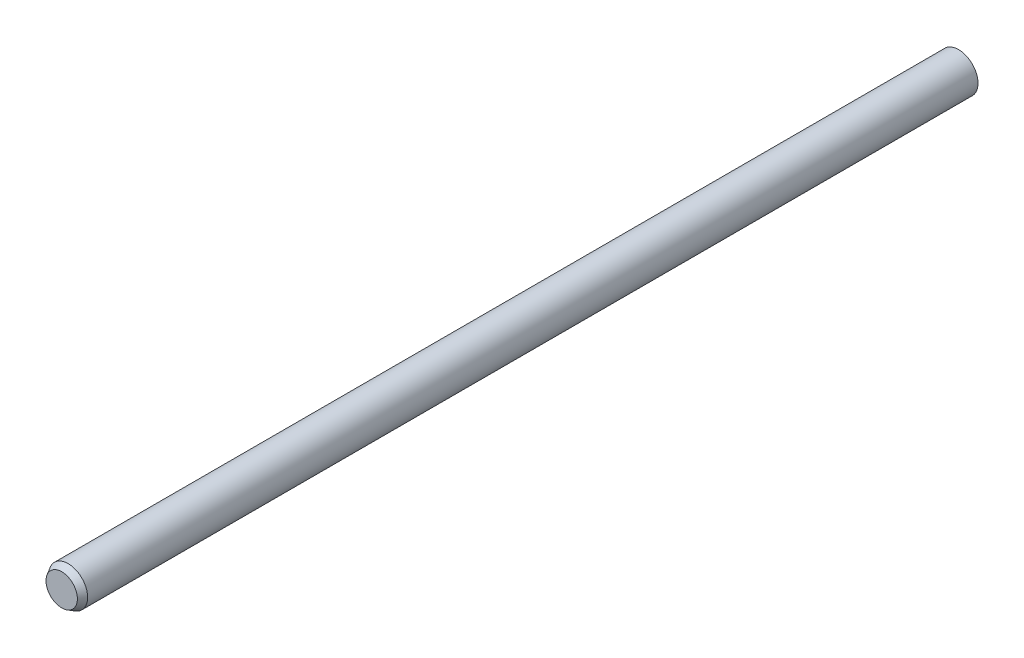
ISO-10303-21;
HEADER;
FILE_DESCRIPTION(('STEP AP214'),'2;1');
FILE_NAME('part.step','',(''),(''),'','','');
FILE_SCHEMA(('AUTOMOTIVE_DESIGN { 1 0 10303 214 1 1 1 1 }'));
ENDSEC;
DATA;
#1=APPLICATION_CONTEXT('core data for automotive mechanical design processes');
#2=APPLICATION_PROTOCOL_DEFINITION('international standard','automotive_design',2000,#1);
#3=PRODUCT_CONTEXT('',#1,'mechanical');
#4=PRODUCT('Part','Part','',(#3));
#5=PRODUCT_RELATED_PRODUCT_CATEGORY('part','',(#4));
#6=PRODUCT_DEFINITION_FORMATION('','',#4);
#7=PRODUCT_DEFINITION_CONTEXT('part definition',#1,'design');
#8=PRODUCT_DEFINITION('design','',#6,#7);
#9=PRODUCT_DEFINITION_SHAPE('','',#8);
#10=(LENGTH_UNIT() NAMED_UNIT(*) SI_UNIT(.MILLI.,.METRE.));
#11=(NAMED_UNIT(*) PLANE_ANGLE_UNIT() SI_UNIT($,.RADIAN.));
#12=(NAMED_UNIT(*) SI_UNIT($,.STERADIAN.) SOLID_ANGLE_UNIT());
#13=UNCERTAINTY_MEASURE_WITH_UNIT(LENGTH_MEASURE(1.E-05),#10,'distance_accuracy_value','');
#14=(GEOMETRIC_REPRESENTATION_CONTEXT(3) GLOBAL_UNCERTAINTY_ASSIGNED_CONTEXT((#13)) GLOBAL_UNIT_ASSIGNED_CONTEXT((#10,
#11,#12)) REPRESENTATION_CONTEXT('',''));
#15=CARTESIAN_POINT('',(0.,0.,0.));
#16=DIRECTION('',(0.,0.,1.));
#17=DIRECTION('',(1.,0.,0.));
#18=AXIS2_PLACEMENT_3D('',#15,#16,#17);
#19=CARTESIAN_POINT('',(0.,1.11022302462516E-13,277.999999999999));
#20=DIRECTION('',(0.,0.,-0.999999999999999));
#21=DIRECTION('',(-1.,0.,0.));
#22=AXIS2_PLACEMENT_3D('',#19,#20,#21);
#23=CYLINDRICAL_SURFACE('',#22,6.);
#24=CARTESIAN_POINT('',(0.,1.11022302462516E-13,275.999999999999));
#25=DIRECTION('',(0.,0.,0.999999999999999));
#26=DIRECTION('',(1.,0.,0.));
#27=AXIS2_PLACEMENT_3D('',#24,#25,#26);
#28=CIRCLE('',#27,6.);
#29=CARTESIAN_POINT('',(-6.00000000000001,1.11023738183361E-13,275.999999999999));
#30=VERTEX_POINT('',#29);
#31=EDGE_CURVE('E40',#30,#30,#28,.F.);
#32=CARTESIAN_POINT('',(0.,0.,1.15470053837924));
#33=DIRECTION('',(0.,0.,0.999999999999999));
#34=DIRECTION('',(1.,0.,0.));
#35=AXIS2_PLACEMENT_3D('',#32,#33,#34);
#36=CIRCLE('',#35,6.);
#37=CARTESIAN_POINT('',(-6.00000000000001,1.11023738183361E-13,1.15470053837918));
#38=VERTEX_POINT('',#37);
#39=EDGE_CURVE('E44',#38,#38,#36,.T.);
#40=CARTESIAN_POINT('',(-6.00000000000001,1.11023738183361E-13,275.999999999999));
#41=CARTESIAN_POINT('',(-6.00000000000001,1.11023738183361E-13,273.137028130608));
#42=CARTESIAN_POINT('',(-6.00000000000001,1.11023738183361E-13,270.274056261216));
#43=CARTESIAN_POINT('',(-6.00000000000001,1.11023738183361E-13,264.548112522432));
#44=CARTESIAN_POINT('',(-6.00000000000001,1.11023738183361E-13,261.68514065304));
#45=CARTESIAN_POINT('',(-6.00000000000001,1.11023738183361E-13,255.959196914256));
#46=CARTESIAN_POINT('',(-6.00000000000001,1.11023738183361E-13,253.096225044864));
#47=CARTESIAN_POINT('',(-6.00000000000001,1.11023738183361E-13,247.370281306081));
#48=CARTESIAN_POINT('',(-6.00000000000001,1.11023738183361E-13,244.507309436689));
#49=CARTESIAN_POINT('',(-6.00000000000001,1.11023738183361E-13,238.781365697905));
#50=CARTESIAN_POINT('',(-6.00000000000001,1.11023738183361E-13,235.918393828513));
#51=CARTESIAN_POINT('',(-6.00000000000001,1.11023738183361E-13,230.192450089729));
#52=CARTESIAN_POINT('',(-6.00000000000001,1.11023738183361E-13,227.329478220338));
#53=CARTESIAN_POINT('',(-6.00000000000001,1.11023738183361E-13,221.603534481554));
#54=CARTESIAN_POINT('',(-6.00000000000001,1.11023738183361E-13,218.740562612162));
#55=CARTESIAN_POINT('',(-6.00000000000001,1.11023738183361E-13,213.014618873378));
#56=CARTESIAN_POINT('',(-6.00000000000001,1.11023738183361E-13,210.151647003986));
#57=CARTESIAN_POINT('',(-6.00000000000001,1.11023738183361E-13,204.425703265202));
#58=CARTESIAN_POINT('',(-6.00000000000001,1.11023738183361E-13,201.562731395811));
#59=CARTESIAN_POINT('',(-6.00000000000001,1.11023738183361E-13,195.836787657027));
#60=CARTESIAN_POINT('',(-6.00000000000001,1.11023738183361E-13,192.973815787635));
#61=CARTESIAN_POINT('',(-6.00000000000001,1.11023738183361E-13,187.247872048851));
#62=CARTESIAN_POINT('',(-6.00000000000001,1.11023738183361E-13,184.384900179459));
#63=CARTESIAN_POINT('',(-6.00000000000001,1.11023738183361E-13,178.658956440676));
#64=CARTESIAN_POINT('',(-6.00000000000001,1.11023738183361E-13,175.795984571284));
#65=CARTESIAN_POINT('',(-6.00000000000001,1.11023738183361E-13,170.0700408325));
#66=CARTESIAN_POINT('',(-6.00000000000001,1.11023738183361E-13,167.207068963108));
#67=CARTESIAN_POINT('',(-6.00000000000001,1.11023738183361E-13,161.481125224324));
#68=CARTESIAN_POINT('',(-6.00000000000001,1.11023738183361E-13,158.618153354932));
#69=CARTESIAN_POINT('',(-6.00000000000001,1.11023738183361E-13,152.892209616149));
#70=CARTESIAN_POINT('',(-6.00000000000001,1.11023738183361E-13,150.029237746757));
#71=CARTESIAN_POINT('',(-6.00000000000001,1.11023738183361E-13,144.303294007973));
#72=CARTESIAN_POINT('',(-6.00000000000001,1.11023738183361E-13,141.440322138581));
#73=CARTESIAN_POINT('',(-6.00000000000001,1.11023738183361E-13,135.714378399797));
#74=CARTESIAN_POINT('',(-6.00000000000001,1.11023738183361E-13,132.851406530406));
#75=CARTESIAN_POINT('',(-6.00000000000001,1.11023738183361E-13,127.125462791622));
#76=CARTESIAN_POINT('',(-6.00000000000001,1.11023738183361E-13,124.26249092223));
#77=CARTESIAN_POINT('',(-6.00000000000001,1.11023738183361E-13,118.536547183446));
#78=CARTESIAN_POINT('',(-6.00000000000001,1.11023738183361E-13,115.673575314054));
#79=CARTESIAN_POINT('',(-6.00000000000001,1.11023738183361E-13,109.947631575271));
#80=CARTESIAN_POINT('',(-6.00000000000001,1.11023738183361E-13,107.084659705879));
#81=CARTESIAN_POINT('',(-6.00000000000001,1.11023738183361E-13,101.358715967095));
#82=CARTESIAN_POINT('',(-6.00000000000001,1.11023738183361E-13,98.495744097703));
#83=CARTESIAN_POINT('',(-6.00000000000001,1.11023738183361E-13,92.7698003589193));
#84=CARTESIAN_POINT('',(-6.00000000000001,1.11023738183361E-13,89.9068284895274));
#85=CARTESIAN_POINT('',(-6.00000000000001,1.11023738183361E-13,84.1808847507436));
#86=CARTESIAN_POINT('',(-6.00000000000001,1.11023738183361E-13,81.3179128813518));
#87=CARTESIAN_POINT('',(-6.00000000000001,1.11023738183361E-13,75.591969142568));
#88=CARTESIAN_POINT('',(-6.00000000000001,1.11023738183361E-13,72.7289972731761));
#89=CARTESIAN_POINT('',(-6.00000000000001,1.11023738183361E-13,67.0030535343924));
#90=CARTESIAN_POINT('',(-6.00000000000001,1.11023738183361E-13,64.1400816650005));
#91=CARTESIAN_POINT('',(-6.00000000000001,1.11023738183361E-13,58.4141379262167));
#92=CARTESIAN_POINT('',(-6.00000000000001,1.11023738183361E-13,55.5511660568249));
#93=CARTESIAN_POINT('',(-6.00000000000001,1.11023738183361E-13,49.8252223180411));
#94=CARTESIAN_POINT('',(-6.00000000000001,1.11023738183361E-13,46.9622504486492));
#95=CARTESIAN_POINT('',(-6.00000000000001,1.11023738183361E-13,41.2363067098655));
#96=CARTESIAN_POINT('',(-6.00000000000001,1.11023738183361E-13,38.3733348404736));
#97=CARTESIAN_POINT('',(-6.00000000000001,1.11023738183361E-13,32.6473911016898));
#98=CARTESIAN_POINT('',(-6.00000000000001,1.11023738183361E-13,29.784419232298));
#99=CARTESIAN_POINT('',(-6.00000000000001,1.11023738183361E-13,24.0584754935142));
#100=CARTESIAN_POINT('',(-6.00000000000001,1.11023738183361E-13,21.1955036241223));
#101=CARTESIAN_POINT('',(-6.00000000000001,1.11023738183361E-13,15.4695598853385));
#102=CARTESIAN_POINT('',(-6.00000000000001,1.11023738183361E-13,12.6065880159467));
#103=CARTESIAN_POINT('',(-6.00000000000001,1.11023738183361E-13,6.88064427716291));
#104=CARTESIAN_POINT('',(-6.00000000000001,1.11023738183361E-13,4.01767240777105));
#105=CARTESIAN_POINT('',(-6.00000000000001,1.11023738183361E-13,1.15470053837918));
#106=B_SPLINE_CURVE_WITH_KNOTS('',3,(#40,#41,#42,#43,#44,#45,#46,#47,#48,#49,#50,#51,#52,#53,
#54,#55,#56,#57,#58,#59,#60,#61,#62,#63,#64,#65,#66,#67,#68,#69,#70,#71,#72,#73,#74,#75,#76,#77,
#78,#79,#80,#81,#82,#83,#84,#85,#86,#87,#88,#89,#90,#91,#92,#93,#94,#95,#96,#97,#98,#99,#100,
#101,#102,#103,#104,#105),.UNSPECIFIED.,.F.,.F.,(4,2,2,2,2,2,2,2,2,2,2,2,2,2,2,2,2,2,2,2,2,2,2,
2,2,2,2,2,2,2,2,2,4),(0.,8.5889156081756,17.1778312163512,25.7667468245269,34.3556624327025,
42.9445780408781,51.5334936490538,60.1224092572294,68.711324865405,77.3002404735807,
85.8891560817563,94.4780716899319,103.066987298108,111.655902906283,120.244818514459,
128.833734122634,137.42264973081,146.011565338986,154.600480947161,163.189396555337,
171.778312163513,180.367227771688,188.956143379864,197.54505898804,206.133974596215,
214.722890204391,223.311805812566,231.900721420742,240.489637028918,249.078552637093,
257.667468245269,266.256383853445,274.84529946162),.UNSPECIFIED.);
#107=EDGE_CURVE('BSEAM34',#30,#38,#106,.T.);
#108=ORIENTED_EDGE('',*,*,#31,.T.);
#109=ORIENTED_EDGE('',*,*,#39,.T.);
#110=ORIENTED_EDGE('',*,*,#107,.T.);
#111=ORIENTED_EDGE('',*,*,#107,.F.);
#112=EDGE_LOOP('',(#108,#110,#109,#111));
#113=FACE_BOUND('',#112,.T.);
#114=ADVANCED_FACE('F34',(#113),#23,.T.);
#115=CARTESIAN_POINT('',(0.,1.11022302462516E-13,277.999999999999));
#116=DIRECTION('',(0.,0.,0.999999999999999));
#117=DIRECTION('',(1.,0.,0.));
#118=AXIS2_PLACEMENT_3D('',#115,#116,#117);
#119=PLANE('',#118);
#120=CARTESIAN_POINT('',(0.,1.11022302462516E-13,277.999999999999));
#121=DIRECTION('',(0.,0.,0.999999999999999));
#122=DIRECTION('',(1.,0.,0.));
#123=AXIS2_PLACEMENT_3D('',#120,#121,#122);
#124=CIRCLE('',#123,4.84529946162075);
#125=CARTESIAN_POINT('',(-4.84529946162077,1.11023461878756E-13,277.999999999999));
#126=VERTEX_POINT('',#125);
#127=EDGE_CURVE('E48',#126,#126,#124,.T.);
#128=ORIENTED_EDGE('',*,*,#127,.T.);
#129=EDGE_LOOP('',(#128));
#130=FACE_BOUND('',#129,.T.);
#131=ADVANCED_FACE('F54',(#130),#119,.T.);
#132=CARTESIAN_POINT('',(0.,0.,0.));
#133=DIRECTION('',(0.,0.,0.999999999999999));
#134=DIRECTION('',(1.,0.,0.));
#135=AXIS2_PLACEMENT_3D('',#132,#133,#134);
#136=PLANE('',#135);
#137=CARTESIAN_POINT('',(0.,0.,0.));
#138=DIRECTION('',(0.,0.,0.999999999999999));
#139=DIRECTION('',(1.,0.,0.));
#140=AXIS2_PLACEMENT_3D('',#137,#138,#139);
#141=CIRCLE('',#140,4.);
#142=CARTESIAN_POINT('',(4.00000000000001,0.,0.));
#143=VERTEX_POINT('',#142);
#144=EDGE_CURVE('E12',#143,#143,#141,.F.);
#145=ORIENTED_EDGE('',*,*,#144,.T.);
#146=EDGE_LOOP('',(#145));
#147=FACE_BOUND('',#146,.T.);
#148=ADVANCED_FACE('F59',(#147),#136,.F.);
#149=CARTESIAN_POINT('',(0.,1.11022302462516E-13,277.999999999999));
#150=DIRECTION('',(0.,0.,-0.999999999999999));
#151=DIRECTION('',(-1.,0.,0.));
#152=AXIS2_PLACEMENT_3D('',#149,#150,#151);
#153=CONICAL_SURFACE('',#152,4.84529946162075,0.5235987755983);
#154=CARTESIAN_POINT('',(-6.00000000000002,1.11023738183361E-13,275.999999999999));
#155=CARTESIAN_POINT('',(-5.9879718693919,1.11023735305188E-13,276.020833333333));
#156=CARTESIAN_POINT('',(-5.97594373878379,1.11023732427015E-13,276.041666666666));
#157=CARTESIAN_POINT('',(-5.95188747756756,1.11023726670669E-13,276.083333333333));
#158=CARTESIAN_POINT('',(-5.93985934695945,1.11023723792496E-13,276.104166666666));
#159=CARTESIAN_POINT('',(-5.91580308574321,1.1102371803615E-13,276.145833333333));
#160=CARTESIAN_POINT('',(-5.90377495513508,1.11023715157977E-13,276.166666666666));
#161=CARTESIAN_POINT('',(-5.87971869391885,1.11023709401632E-13,276.208333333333));
#162=CARTESIAN_POINT('',(-5.86769056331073,1.11023706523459E-13,276.229166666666));
#163=CARTESIAN_POINT('',(-5.8436343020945,1.11023700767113E-13,276.270833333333));
#164=CARTESIAN_POINT('',(-5.83160617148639,1.1102369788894E-13,276.291666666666));
#165=CARTESIAN_POINT('',(-5.80754991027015,1.11023692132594E-13,276.333333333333));
#166=CARTESIAN_POINT('',(-5.79552177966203,1.11023689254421E-13,276.354166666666));
#167=CARTESIAN_POINT('',(-5.77146551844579,1.11023683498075E-13,276.395833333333));
#168=CARTESIAN_POINT('',(-5.75943738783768,1.11023680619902E-13,276.416666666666));
#169=CARTESIAN_POINT('',(-5.73538112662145,1.11023674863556E-13,276.458333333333));
#170=CARTESIAN_POINT('',(-5.72335299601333,1.11023671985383E-13,276.479166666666));
#171=CARTESIAN_POINT('',(-5.69929673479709,1.11023666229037E-13,276.520833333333));
#172=CARTESIAN_POINT('',(-5.68726860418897,1.11023663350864E-13,276.541666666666));
#173=CARTESIAN_POINT('',(-5.66321234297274,1.11023657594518E-13,276.583333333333));
#174=CARTESIAN_POINT('',(-5.65118421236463,1.11023654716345E-13,276.604166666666));
#175=CARTESIAN_POINT('',(-5.62712795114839,1.11023648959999E-13,276.645833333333));
#176=CARTESIAN_POINT('',(-5.61509982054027,1.11023646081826E-13,276.666666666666));
#177=CARTESIAN_POINT('',(-5.59104355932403,1.1102364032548E-13,276.708333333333));
#178=CARTESIAN_POINT('',(-5.57901542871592,1.11023637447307E-13,276.729166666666));
#179=CARTESIAN_POINT('',(-5.55495916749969,1.11023631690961E-13,276.770833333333));
#180=CARTESIAN_POINT('',(-5.54293103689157,1.11023628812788E-13,276.791666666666));
#181=CARTESIAN_POINT('',(-5.51887477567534,1.11023623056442E-13,276.833333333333));
#182=CARTESIAN_POINT('',(-5.50684664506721,1.11023620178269E-13,276.854166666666));
#183=CARTESIAN_POINT('',(-5.48279038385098,1.11023614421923E-13,276.895833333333));
#184=CARTESIAN_POINT('',(-5.47076225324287,1.1102361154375E-13,276.916666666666));
#185=CARTESIAN_POINT('',(-5.44670599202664,1.11023605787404E-13,276.958333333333));
#186=CARTESIAN_POINT('',(-5.43467786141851,1.11023602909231E-13,276.979166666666));
#187=CARTESIAN_POINT('',(-5.41062160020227,1.11023597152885E-13,277.020833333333));
#188=CARTESIAN_POINT('',(-5.39859346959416,1.11023594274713E-13,277.041666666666));
#189=CARTESIAN_POINT('',(-5.37453720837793,1.11023588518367E-13,277.083333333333));
#190=CARTESIAN_POINT('',(-5.36250907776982,1.11023585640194E-13,277.104166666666));
#191=CARTESIAN_POINT('',(-5.33845281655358,1.11023579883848E-13,277.145833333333));
#192=CARTESIAN_POINT('',(-5.32642468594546,1.11023577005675E-13,277.166666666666));
#193=CARTESIAN_POINT('',(-5.30236842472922,1.11023571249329E-13,277.208333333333));
#194=CARTESIAN_POINT('',(-5.2903402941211,1.11023568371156E-13,277.229166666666));
#195=CARTESIAN_POINT('',(-5.26628403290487,1.1102356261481E-13,277.270833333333));
#196=CARTESIAN_POINT('',(-5.25425590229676,1.11023559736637E-13,277.291666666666));
#197=CARTESIAN_POINT('',(-5.23019964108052,1.11023553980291E-13,277.333333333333));
#198=CARTESIAN_POINT('',(-5.2181715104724,1.11023551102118E-13,277.354166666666));
#199=CARTESIAN_POINT('',(-5.19411524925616,1.11023545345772E-13,277.395833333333));
#200=CARTESIAN_POINT('',(-5.18208711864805,1.11023542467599E-13,277.416666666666));
#201=CARTESIAN_POINT('',(-5.15803085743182,1.11023536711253E-13,277.458333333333));
#202=CARTESIAN_POINT('',(-5.1460027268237,1.1102353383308E-13,277.479166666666));
#203=CARTESIAN_POINT('',(-5.12194646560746,1.11023528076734E-13,277.520833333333));
#204=CARTESIAN_POINT('',(-5.10991833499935,1.11023525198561E-13,277.541666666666));
#205=CARTESIAN_POINT('',(-5.08586207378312,1.11023519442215E-13,277.583333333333));
#206=CARTESIAN_POINT('',(-5.073833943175,1.11023516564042E-13,277.604166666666));
#207=CARTESIAN_POINT('',(-5.04977768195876,1.11023510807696E-13,277.645833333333));
#208=CARTESIAN_POINT('',(-5.03774955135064,1.11023507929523E-13,277.666666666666));
#209=CARTESIAN_POINT('',(-5.0136932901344,1.11023502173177E-13,277.708333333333));
#210=CARTESIAN_POINT('',(-5.00166515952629,1.11023499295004E-13,277.729166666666));
#211=CARTESIAN_POINT('',(-4.97760889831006,1.11023493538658E-13,277.770833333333));
#212=CARTESIAN_POINT('',(-4.96558076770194,1.11023490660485E-13,277.791666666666));
#213=CARTESIAN_POINT('',(-4.94152450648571,1.11023484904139E-13,277.833333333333));
#214=CARTESIAN_POINT('',(-4.92949637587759,1.11023482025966E-13,277.854166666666));
#215=CARTESIAN_POINT('',(-4.90544011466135,1.11023476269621E-13,277.895833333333));
#216=CARTESIAN_POINT('',(-4.89341198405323,1.11023473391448E-13,277.916666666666));
#217=CARTESIAN_POINT('',(-4.869355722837,1.11023467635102E-13,277.958333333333));
#218=CARTESIAN_POINT('',(-4.85732759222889,1.11023464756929E-13,277.979166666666));
#219=CARTESIAN_POINT('',(-4.84529946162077,1.11023461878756E-13,277.999999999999));
#220=B_SPLINE_CURVE_WITH_KNOTS('',3,(#154,#155,#156,#157,#158,#159,#160,#161,#162,#163,#164,
#165,#166,#167,#168,#169,#170,#171,#172,#173,#174,#175,#176,#177,#178,#179,#180,#181,#182,#183,
#184,#185,#186,#187,#188,#189,#190,#191,#192,#193,#194,#195,#196,#197,#198,#199,#200,#201,#202,
#203,#204,#205,#206,#207,#208,#209,#210,#211,#212,#213,#214,#215,#216,#217,#218,#219),
.UNSPECIFIED.,.F.,.F.,(4,2,2,2,2,2,2,2,2,2,2,2,2,2,2,2,2,2,2,2,2,2,2,2,2,2,2,2,2,2,2,2,4),(0.,
0.0721687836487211,0.144337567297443,0.216506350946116,0.288675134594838,0.360843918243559,
0.433012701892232,0.505181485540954,0.577350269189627,0.649519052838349,0.72168783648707,
0.793856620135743,0.866025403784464,0.938194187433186,1.01036297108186,1.08253175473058,
1.15470053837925,1.22686932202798,1.2990381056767,1.37120688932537,1.44337567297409,
1.51554445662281,1.58771324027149,1.65988202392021,1.73205080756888,1.8042195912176,
1.87638837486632,1.948557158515,2.02072594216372,2.09289472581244,2.16506350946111,
2.23723229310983,2.30940107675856),.UNSPECIFIED.);
#221=EDGE_CURVE('BSEAM56',#30,#126,#220,.T.);
#222=ORIENTED_EDGE('',*,*,#31,.F.);
#223=ORIENTED_EDGE('',*,*,#127,.F.);
#224=ORIENTED_EDGE('',*,*,#221,.T.);
#225=ORIENTED_EDGE('',*,*,#221,.F.);
#226=EDGE_LOOP('',(#222,#224,#223,#225));
#227=FACE_BOUND('',#226,.T.);
#228=ADVANCED_FACE('F56',(#227),#153,.T.);
#229=CARTESIAN_POINT('',(0.,0.,1.15470053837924));
#230=DIRECTION('',(0.,0.,0.999999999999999));
#231=DIRECTION('',(1.,0.,0.));
#232=AXIS2_PLACEMENT_3D('',#229,#230,#231);
#233=CONICAL_SURFACE('',#232,6.,1.0471975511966);
#234=ORIENTED_EDGE('',*,*,#144,.F.);
#235=EDGE_LOOP('',(#234));
#236=FACE_BOUND('',#235,.T.);
#237=ORIENTED_EDGE('',*,*,#39,.F.);
#238=EDGE_LOOP('',(#237));
#239=FACE_BOUND('',#238,.T.);
#240=ADVANCED_FACE('F58',(#236,#239),#233,.T.);
#241=CLOSED_SHELL('',(#114,#131,#148,#228,#240));
#242=MANIFOLD_SOLID_BREP('B2',#241);
#243=ADVANCED_BREP_SHAPE_REPRESENTATION('',(#18,#242),#14);
#244=SHAPE_DEFINITION_REPRESENTATION(#9,#243);
ENDSEC;
END-ISO-10303-21;
